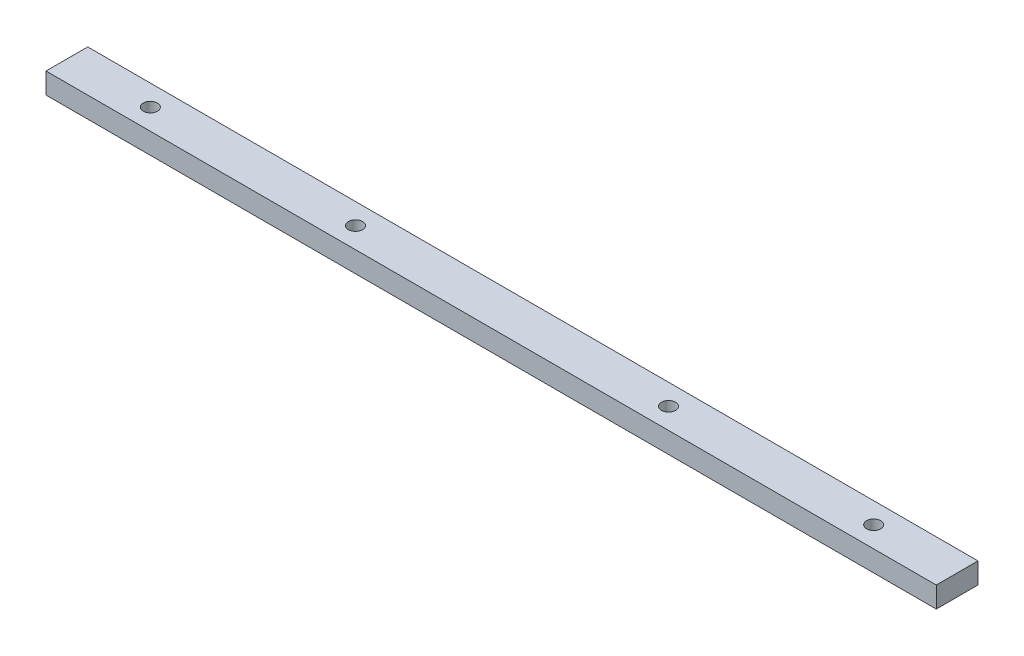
ISO-10303-21;
HEADER;
FILE_DESCRIPTION(('STEP AP214'),'2;1');
FILE_NAME('part.step','',(''),(''),'','','');
FILE_SCHEMA(('AUTOMOTIVE_DESIGN { 1 0 10303 214 1 1 1 1 }'));
ENDSEC;
DATA;
#1=APPLICATION_CONTEXT('core data for automotive mechanical design processes');
#2=APPLICATION_PROTOCOL_DEFINITION('international standard','automotive_design',2000,#1);
#3=PRODUCT_CONTEXT('',#1,'mechanical');
#4=PRODUCT('Part','Part','',(#3));
#5=PRODUCT_RELATED_PRODUCT_CATEGORY('part','',(#4));
#6=PRODUCT_DEFINITION_FORMATION('','',#4);
#7=PRODUCT_DEFINITION_CONTEXT('part definition',#1,'design');
#8=PRODUCT_DEFINITION('design','',#6,#7);
#9=PRODUCT_DEFINITION_SHAPE('','',#8);
#10=(LENGTH_UNIT() NAMED_UNIT(*) SI_UNIT(.MILLI.,.METRE.));
#11=(NAMED_UNIT(*) PLANE_ANGLE_UNIT() SI_UNIT($,.RADIAN.));
#12=(NAMED_UNIT(*) SI_UNIT($,.STERADIAN.) SOLID_ANGLE_UNIT());
#13=UNCERTAINTY_MEASURE_WITH_UNIT(LENGTH_MEASURE(1.E-05),#10,'distance_accuracy_value','');
#14=(GEOMETRIC_REPRESENTATION_CONTEXT(3) GLOBAL_UNCERTAINTY_ASSIGNED_CONTEXT((#13)) GLOBAL_UNIT_ASSIGNED_CONTEXT((#10,
#11,#12)) REPRESENTATION_CONTEXT('',''));
#15=CARTESIAN_POINT('',(0.,0.,0.));
#16=DIRECTION('',(0.,0.,1.));
#17=DIRECTION('',(1.,0.,0.));
#18=AXIS2_PLACEMENT_3D('',#15,#16,#17);
#19=CARTESIAN_POINT('',(320.,0.,15.));
#20=DIRECTION('',(0.,-1.,0.));
#21=DIRECTION('',(0.,0.,-1.));
#22=AXIS2_PLACEMENT_3D('',#19,#20,#21);
#23=PLANE('',#22);
#24=CARTESIAN_POINT('',(-112.5,0.,0.));
#25=DIRECTION('',(0.,1.,0.));
#26=DIRECTION('',(0.,0.,1.));
#27=AXIS2_PLACEMENT_3D('',#24,#25,#26);
#28=CIRCLE('',#27,5.09999999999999);
#29=CARTESIAN_POINT('',(-112.5,0.,5.09999999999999));
#30=VERTEX_POINT('',#29);
#31=EDGE_CURVE('E186',#30,#30,#28,.T.);
#32=ORIENTED_EDGE('',*,*,#31,.F.);
#33=EDGE_LOOP('',(#32));
#34=FACE_BOUND('',#33,.T.);
#35=CARTESIAN_POINT('',(260.,0.,0.));
#36=DIRECTION('',(0.,1.,0.));
#37=DIRECTION('',(0.,0.,1.));
#38=AXIS2_PLACEMENT_3D('',#35,#36,#37);
#39=CIRCLE('',#38,5.09999999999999);
#40=CARTESIAN_POINT('',(260.,0.,5.09999999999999));
#41=VERTEX_POINT('',#40);
#42=EDGE_CURVE('E107',#41,#41,#39,.T.);
#43=ORIENTED_EDGE('',*,*,#42,.F.);
#44=EDGE_LOOP('',(#43));
#45=FACE_BOUND('',#44,.T.);
#46=DIRECTION('',(0.,0.,1.));
#47=VECTOR('',#46,1.);
#48=CARTESIAN_POINT('',(-320.,0.,15.));
#49=LINE('',#48,#47);
#50=CARTESIAN_POINT('',(-320.,0.,-15.));
#51=VERTEX_POINT('',#50);
#52=CARTESIAN_POINT('',(-320.,0.,15.));
#53=VERTEX_POINT('',#52);
#54=EDGE_CURVE('E113',#51,#53,#49,.T.);
#55=ORIENTED_EDGE('',*,*,#54,.T.);
#56=DIRECTION('',(-1.,0.,0.));
#57=VECTOR('',#56,1.);
#58=CARTESIAN_POINT('',(320.,0.,15.));
#59=LINE('',#58,#57);
#60=CARTESIAN_POINT('',(320.,0.,15.));
#61=VERTEX_POINT('',#60);
#62=EDGE_CURVE('E99',#61,#53,#59,.T.);
#63=ORIENTED_EDGE('',*,*,#62,.F.);
#64=DIRECTION('',(0.,0.,1.));
#65=VECTOR('',#64,1.);
#66=CARTESIAN_POINT('',(320.,0.,15.));
#67=LINE('',#66,#65);
#68=CARTESIAN_POINT('',(320.,0.,-15.));
#69=VERTEX_POINT('',#68);
#70=EDGE_CURVE('E56',#69,#61,#67,.T.);
#71=ORIENTED_EDGE('',*,*,#70,.F.);
#72=DIRECTION('',(-1.,0.,0.));
#73=VECTOR('',#72,1.);
#74=CARTESIAN_POINT('',(320.,0.,-15.));
#75=LINE('',#74,#73);
#76=EDGE_CURVE('E126',#69,#51,#75,.T.);
#77=ORIENTED_EDGE('',*,*,#76,.T.);
#78=EDGE_LOOP('',(#55,#63,#71,#77));
#79=FACE_BOUND('',#78,.T.);
#80=CARTESIAN_POINT('',(112.5,0.,0.));
#81=DIRECTION('',(0.,1.,0.));
#82=DIRECTION('',(0.,0.,1.));
#83=AXIS2_PLACEMENT_3D('',#80,#81,#82);
#84=CIRCLE('',#83,5.09999999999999);
#85=CARTESIAN_POINT('',(112.5,0.,5.09999999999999));
#86=VERTEX_POINT('',#85);
#87=EDGE_CURVE('E178',#86,#86,#84,.T.);
#88=ORIENTED_EDGE('',*,*,#87,.F.);
#89=EDGE_LOOP('',(#88));
#90=FACE_BOUND('',#89,.T.);
#91=CARTESIAN_POINT('',(-260.,0.,0.));
#92=DIRECTION('',(0.,1.,0.));
#93=DIRECTION('',(0.,0.,1.));
#94=AXIS2_PLACEMENT_3D('',#91,#92,#93);
#95=CIRCLE('',#94,5.09999999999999);
#96=CARTESIAN_POINT('',(-260.,0.,5.09999999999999));
#97=VERTEX_POINT('',#96);
#98=EDGE_CURVE('E191',#97,#97,#95,.T.);
#99=ORIENTED_EDGE('',*,*,#98,.F.);
#100=EDGE_LOOP('',(#99));
#101=FACE_BOUND('',#100,.T.);
#102=ADVANCED_FACE('F40',(#34,#45,#79,#90,#101),#23,.F.);
#103=CARTESIAN_POINT('',(320.,0.,15.));
#104=DIRECTION('',(0.,0.,-1.));
#105=DIRECTION('',(-1.,0.,0.));
#106=AXIS2_PLACEMENT_3D('',#103,#104,#105);
#107=PLANE('',#106);
#108=DIRECTION('',(0.,-1.,0.));
#109=VECTOR('',#108,1.);
#110=CARTESIAN_POINT('',(-320.,0.,15.));
#111=LINE('',#110,#109);
#112=CARTESIAN_POINT('',(-320.,-15.,15.));
#113=VERTEX_POINT('',#112);
#114=EDGE_CURVE('E86',#53,#113,#111,.T.);
#115=ORIENTED_EDGE('',*,*,#114,.T.);
#116=DIRECTION('',(-1.,0.,0.));
#117=VECTOR('',#116,1.);
#118=CARTESIAN_POINT('',(320.,-15.,15.));
#119=LINE('',#118,#117);
#120=CARTESIAN_POINT('',(320.,-15.,15.));
#121=VERTEX_POINT('',#120);
#122=EDGE_CURVE('E11',#121,#113,#119,.T.);
#123=ORIENTED_EDGE('',*,*,#122,.F.);
#124=DIRECTION('',(0.,-1.,0.));
#125=VECTOR('',#124,1.);
#126=CARTESIAN_POINT('',(320.,0.,15.));
#127=LINE('',#126,#125);
#128=EDGE_CURVE('E116',#61,#121,#127,.T.);
#129=ORIENTED_EDGE('',*,*,#128,.F.);
#130=ORIENTED_EDGE('',*,*,#62,.T.);
#131=EDGE_LOOP('',(#115,#123,#129,#130));
#132=FACE_BOUND('',#131,.T.);
#133=ADVANCED_FACE('F42',(#132),#107,.F.);
#134=CARTESIAN_POINT('',(320.,-15.,15.));
#135=DIRECTION('',(0.,1.,0.));
#136=DIRECTION('',(0.,0.,1.));
#137=AXIS2_PLACEMENT_3D('',#134,#135,#136);
#138=PLANE('',#137);
#139=CARTESIAN_POINT('',(-260.,-15.,0.));
#140=DIRECTION('',(0.,1.,0.));
#141=DIRECTION('',(0.,0.,1.));
#142=AXIS2_PLACEMENT_3D('',#139,#140,#141);
#143=CIRCLE('',#142,5.09999999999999);
#144=CARTESIAN_POINT('',(-260.,-15.,5.09999999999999));
#145=VERTEX_POINT('',#144);
#146=EDGE_CURVE('E160',#145,#145,#143,.T.);
#147=ORIENTED_EDGE('',*,*,#146,.T.);
#148=EDGE_LOOP('',(#147));
#149=FACE_BOUND('',#148,.T.);
#150=CARTESIAN_POINT('',(-112.5,-15.,0.));
#151=DIRECTION('',(0.,1.,0.));
#152=DIRECTION('',(0.,0.,1.));
#153=AXIS2_PLACEMENT_3D('',#150,#151,#152);
#154=CIRCLE('',#153,5.09999999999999);
#155=CARTESIAN_POINT('',(-112.5,-15.,5.09999999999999));
#156=VERTEX_POINT('',#155);
#157=EDGE_CURVE('E164',#156,#156,#154,.T.);
#158=ORIENTED_EDGE('',*,*,#157,.T.);
#159=EDGE_LOOP('',(#158));
#160=FACE_BOUND('',#159,.T.);
#161=CARTESIAN_POINT('',(112.5,-15.,0.));
#162=DIRECTION('',(0.,1.,0.));
#163=DIRECTION('',(0.,0.,1.));
#164=AXIS2_PLACEMENT_3D('',#161,#162,#163);
#165=CIRCLE('',#164,5.09999999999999);
#166=CARTESIAN_POINT('',(112.5,-15.,5.09999999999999));
#167=VERTEX_POINT('',#166);
#168=EDGE_CURVE('E168',#167,#167,#165,.T.);
#169=ORIENTED_EDGE('',*,*,#168,.T.);
#170=EDGE_LOOP('',(#169));
#171=FACE_BOUND('',#170,.T.);
#172=CARTESIAN_POINT('',(260.,-15.,0.));
#173=DIRECTION('',(0.,1.,0.));
#174=DIRECTION('',(0.,0.,1.));
#175=AXIS2_PLACEMENT_3D('',#172,#173,#174);
#176=CIRCLE('',#175,5.09999999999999);
#177=CARTESIAN_POINT('',(260.,-15.,5.09999999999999));
#178=VERTEX_POINT('',#177);
#179=EDGE_CURVE('E101',#178,#178,#176,.T.);
#180=ORIENTED_EDGE('',*,*,#179,.T.);
#181=EDGE_LOOP('',(#180));
#182=FACE_BOUND('',#181,.T.);
#183=DIRECTION('',(0.,0.,-1.));
#184=VECTOR('',#183,1.);
#185=CARTESIAN_POINT('',(-320.,-15.,15.));
#186=LINE('',#185,#184);
#187=CARTESIAN_POINT('',(-320.,-15.,-15.));
#188=VERTEX_POINT('',#187);
#189=EDGE_CURVE('E82',#113,#188,#186,.T.);
#190=ORIENTED_EDGE('',*,*,#189,.T.);
#191=DIRECTION('',(-1.,0.,0.));
#192=VECTOR('',#191,1.);
#193=CARTESIAN_POINT('',(320.,-15.,-15.));
#194=LINE('',#193,#192);
#195=CARTESIAN_POINT('',(320.,-15.,-15.));
#196=VERTEX_POINT('',#195);
#197=EDGE_CURVE('E49',#196,#188,#194,.T.);
#198=ORIENTED_EDGE('',*,*,#197,.F.);
#199=DIRECTION('',(0.,0.,-1.));
#200=VECTOR('',#199,1.);
#201=CARTESIAN_POINT('',(320.,-15.,15.));
#202=LINE('',#201,#200);
#203=EDGE_CURVE('E95',#121,#196,#202,.T.);
#204=ORIENTED_EDGE('',*,*,#203,.F.);
#205=ORIENTED_EDGE('',*,*,#122,.T.);
#206=EDGE_LOOP('',(#190,#198,#204,#205));
#207=FACE_BOUND('',#206,.T.);
#208=ADVANCED_FACE('F94',(#149,#160,#171,#182,#207),#138,.F.);
#209=CARTESIAN_POINT('',(320.,0.,-15.));
#210=DIRECTION('',(0.,0.,1.));
#211=DIRECTION('',(1.,0.,0.));
#212=AXIS2_PLACEMENT_3D('',#209,#210,#211);
#213=PLANE('',#212);
#214=DIRECTION('',(0.,1.,0.));
#215=VECTOR('',#214,1.);
#216=CARTESIAN_POINT('',(-320.,0.,-15.));
#217=LINE('',#216,#215);
#218=EDGE_CURVE('E87',#188,#51,#217,.T.);
#219=ORIENTED_EDGE('',*,*,#218,.T.);
#220=ORIENTED_EDGE('',*,*,#76,.F.);
#221=DIRECTION('',(0.,1.,0.));
#222=VECTOR('',#221,1.);
#223=CARTESIAN_POINT('',(320.,0.,-15.));
#224=LINE('',#223,#222);
#225=EDGE_CURVE('E61',#196,#69,#224,.T.);
#226=ORIENTED_EDGE('',*,*,#225,.F.);
#227=ORIENTED_EDGE('',*,*,#197,.T.);
#228=EDGE_LOOP('',(#219,#220,#226,#227));
#229=FACE_BOUND('',#228,.T.);
#230=ADVANCED_FACE('F132',(#229),#213,.F.);
#231=CARTESIAN_POINT('',(320.,-15.,15.));
#232=DIRECTION('',(1.,0.,0.));
#233=DIRECTION('',(0.,0.,-1.));
#234=AXIS2_PLACEMENT_3D('',#231,#232,#233);
#235=PLANE('',#234);
#236=ORIENTED_EDGE('',*,*,#128,.T.);
#237=ORIENTED_EDGE('',*,*,#203,.T.);
#238=ORIENTED_EDGE('',*,*,#225,.T.);
#239=ORIENTED_EDGE('',*,*,#70,.T.);
#240=EDGE_LOOP('',(#236,#237,#238,#239));
#241=FACE_BOUND('',#240,.T.);
#242=ADVANCED_FACE('F135',(#241),#235,.T.);
#243=CARTESIAN_POINT('',(-320.,-15.,15.));
#244=DIRECTION('',(1.,0.,0.));
#245=DIRECTION('',(0.,0.,-1.));
#246=AXIS2_PLACEMENT_3D('',#243,#244,#245);
#247=PLANE('',#246);
#248=ORIENTED_EDGE('',*,*,#114,.F.);
#249=ORIENTED_EDGE('',*,*,#54,.F.);
#250=ORIENTED_EDGE('',*,*,#218,.F.);
#251=ORIENTED_EDGE('',*,*,#189,.F.);
#252=EDGE_LOOP('',(#248,#249,#250,#251));
#253=FACE_BOUND('',#252,.T.);
#254=ADVANCED_FACE('F83',(#253),#247,.F.);
#255=CARTESIAN_POINT('',(260.,0.,0.));
#256=DIRECTION('',(0.,1.,0.));
#257=DIRECTION('',(0.,0.,1.));
#258=AXIS2_PLACEMENT_3D('',#255,#256,#257);
#259=CYLINDRICAL_SURFACE('',#258,5.09999999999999);
#260=ORIENTED_EDGE('',*,*,#179,.F.);
#261=EDGE_LOOP('',(#260));
#262=FACE_BOUND('',#261,.T.);
#263=ORIENTED_EDGE('',*,*,#42,.T.);
#264=EDGE_LOOP('',(#263));
#265=FACE_BOUND('',#264,.T.);
#266=ADVANCED_FACE('F142',(#262,#265),#259,.F.);
#267=CARTESIAN_POINT('',(112.5,0.,0.));
#268=DIRECTION('',(0.,1.,0.));
#269=DIRECTION('',(0.,0.,1.));
#270=AXIS2_PLACEMENT_3D('',#267,#268,#269);
#271=CYLINDRICAL_SURFACE('',#270,5.09999999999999);
#272=ORIENTED_EDGE('',*,*,#168,.F.);
#273=EDGE_LOOP('',(#272));
#274=FACE_BOUND('',#273,.T.);
#275=ORIENTED_EDGE('',*,*,#87,.T.);
#276=EDGE_LOOP('',(#275));
#277=FACE_BOUND('',#276,.T.);
#278=ADVANCED_FACE('F173',(#274,#277),#271,.F.);
#279=CARTESIAN_POINT('',(-112.5,0.,0.));
#280=DIRECTION('',(0.,1.,0.));
#281=DIRECTION('',(0.,0.,1.));
#282=AXIS2_PLACEMENT_3D('',#279,#280,#281);
#283=CYLINDRICAL_SURFACE('',#282,5.09999999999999);
#284=ORIENTED_EDGE('',*,*,#157,.F.);
#285=EDGE_LOOP('',(#284));
#286=FACE_BOUND('',#285,.T.);
#287=ORIENTED_EDGE('',*,*,#31,.T.);
#288=EDGE_LOOP('',(#287));
#289=FACE_BOUND('',#288,.T.);
#290=ADVANCED_FACE('F199',(#286,#289),#283,.F.);
#291=CARTESIAN_POINT('',(-260.,0.,0.));
#292=DIRECTION('',(0.,1.,0.));
#293=DIRECTION('',(0.,0.,1.));
#294=AXIS2_PLACEMENT_3D('',#291,#292,#293);
#295=CYLINDRICAL_SURFACE('',#294,5.09999999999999);
#296=ORIENTED_EDGE('',*,*,#146,.F.);
#297=EDGE_LOOP('',(#296));
#298=FACE_BOUND('',#297,.T.);
#299=ORIENTED_EDGE('',*,*,#98,.T.);
#300=EDGE_LOOP('',(#299));
#301=FACE_BOUND('',#300,.T.);
#302=ADVANCED_FACE('F196',(#298,#301),#295,.F.);
#303=CLOSED_SHELL('',(#102,#133,#208,#230,#242,#254,#266,#278,#290,#302));
#304=MANIFOLD_SOLID_BREP('B2',#303);
#305=ADVANCED_BREP_SHAPE_REPRESENTATION('',(#18,#304),#14);
#306=SHAPE_DEFINITION_REPRESENTATION(#9,#305);
ENDSEC;
END-ISO-10303-21;
